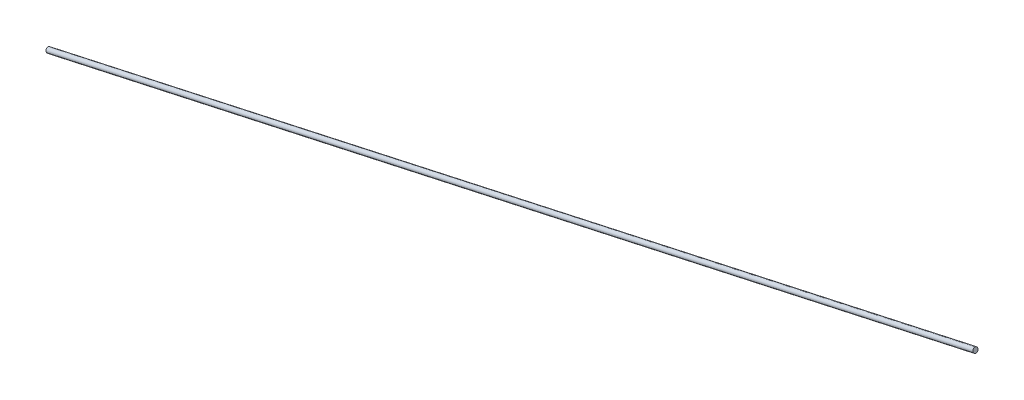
ISO-10303-21;
HEADER;
FILE_DESCRIPTION(('STEP AP214'),'2;1');
FILE_NAME('part.step','',(''),(''),'','','');
FILE_SCHEMA(('AUTOMOTIVE_DESIGN { 1 0 10303 214 1 1 1 1 }'));
ENDSEC;
DATA;
#1=APPLICATION_CONTEXT('core data for automotive mechanical design processes');
#2=APPLICATION_PROTOCOL_DEFINITION('international standard','automotive_design',2000,#1);
#3=PRODUCT_CONTEXT('',#1,'mechanical');
#4=PRODUCT('Part','Part','',(#3));
#5=PRODUCT_RELATED_PRODUCT_CATEGORY('part','',(#4));
#6=PRODUCT_DEFINITION_FORMATION('','',#4);
#7=PRODUCT_DEFINITION_CONTEXT('part definition',#1,'design');
#8=PRODUCT_DEFINITION('design','',#6,#7);
#9=PRODUCT_DEFINITION_SHAPE('','',#8);
#10=(LENGTH_UNIT() NAMED_UNIT(*) SI_UNIT(.MILLI.,.METRE.));
#11=(NAMED_UNIT(*) PLANE_ANGLE_UNIT() SI_UNIT($,.RADIAN.));
#12=(NAMED_UNIT(*) SI_UNIT($,.STERADIAN.) SOLID_ANGLE_UNIT());
#13=UNCERTAINTY_MEASURE_WITH_UNIT(LENGTH_MEASURE(1.E-05),#10,'distance_accuracy_value','');
#14=(GEOMETRIC_REPRESENTATION_CONTEXT(3) GLOBAL_UNCERTAINTY_ASSIGNED_CONTEXT((#13)) GLOBAL_UNIT_ASSIGNED_CONTEXT((#10,
#11,#12)) REPRESENTATION_CONTEXT('',''));
#15=CARTESIAN_POINT('',(0.,0.,0.));
#16=DIRECTION('',(0.,0.,1.));
#17=DIRECTION('',(1.,0.,0.));
#18=AXIS2_PLACEMENT_3D('',#15,#16,#17);
#19=CARTESIAN_POINT('',(-161.1456691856,-32.61399418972,-13.06579615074));
#20=DIRECTION('',(-0.976717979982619,-0.214527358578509,0.));
#21=DIRECTION('',(0.,0.,-1.));
#22=AXIS2_PLACEMENT_3D('',#19,#20,#21);
#23=PLANE('',#22);
#24=CARTESIAN_POINT('',(-161.05037530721,-33.0478560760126,-13.509999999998));
#25=DIRECTION('',(-0.976717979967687,-0.214527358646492,0.));
#26=DIRECTION('',(0.214527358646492,-0.976717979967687,0.));
#27=AXIS2_PLACEMENT_3D('',#24,#25,#26);
#28=CIRCLE('',#27,0.305000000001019);
#29=CARTESIAN_POINT('',(-160.984944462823,-33.3457550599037,-13.509999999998));
#30=VERTEX_POINT('',#29);
#31=EDGE_CURVE('E18',#30,#30,#28,.T.);
#32=ORIENTED_EDGE('',*,*,#31,.T.);
#33=EDGE_LOOP('',(#32));
#34=FACE_BOUND('',#33,.T.);
#35=ADVANCED_FACE('F14',(#34),#23,.T.);
#36=CARTESIAN_POINT('',(-47.75108963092,-8.162682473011,-13.51));
#37=DIRECTION('',(-0.976717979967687,-0.214527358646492,0.));
#38=DIRECTION('',(0.214527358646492,-0.976717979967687,0.));
#39=AXIS2_PLACEMENT_3D('',#36,#37,#38);
#40=CYLINDRICAL_SURFACE('',#39,0.305000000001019);
#41=ORIENTED_EDGE('',*,*,#31,.F.);
#42=EDGE_LOOP('',(#41));
#43=FACE_BOUND('',#42,.T.);
#44=CARTESIAN_POINT('',(-47.75108963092,-8.162682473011,-13.51));
#45=DIRECTION('',(-0.976717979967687,-0.214527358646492,0.));
#46=DIRECTION('',(0.214527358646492,-0.976717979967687,0.));
#47=AXIS2_PLACEMENT_3D('',#44,#45,#46);
#48=CIRCLE('',#47,0.305000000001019);
#49=CARTESIAN_POINT('',(-47.6856587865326,-8.46058145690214,-13.51));
#50=VERTEX_POINT('',#49);
#51=EDGE_CURVE('E10',#50,#50,#48,.T.);
#52=ORIENTED_EDGE('',*,*,#51,.T.);
#53=EDGE_LOOP('',(#52));
#54=FACE_BOUND('',#53,.T.);
#55=ADVANCED_FACE('F28',(#43,#54),#40,.T.);
#56=CARTESIAN_POINT('',(-47.84638350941,-7.728820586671,-13.06579615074));
#57=DIRECTION('',(-0.976717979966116,-0.214527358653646,0.));
#58=DIRECTION('',(0.,0.,-1.));
#59=AXIS2_PLACEMENT_3D('',#56,#57,#58);
#60=PLANE('',#59);
#61=ORIENTED_EDGE('',*,*,#51,.F.);
#62=EDGE_LOOP('',(#61));
#63=FACE_BOUND('',#62,.T.);
#64=ADVANCED_FACE('F16',(#63),#60,.F.);
#65=CLOSED_SHELL('',(#35,#55,#64));
#66=MANIFOLD_SOLID_BREP('B1',#65);
#67=ADVANCED_BREP_SHAPE_REPRESENTATION('',(#18,#66),#14);
#68=SHAPE_DEFINITION_REPRESENTATION(#9,#67);
ENDSEC;
END-ISO-10303-21;
